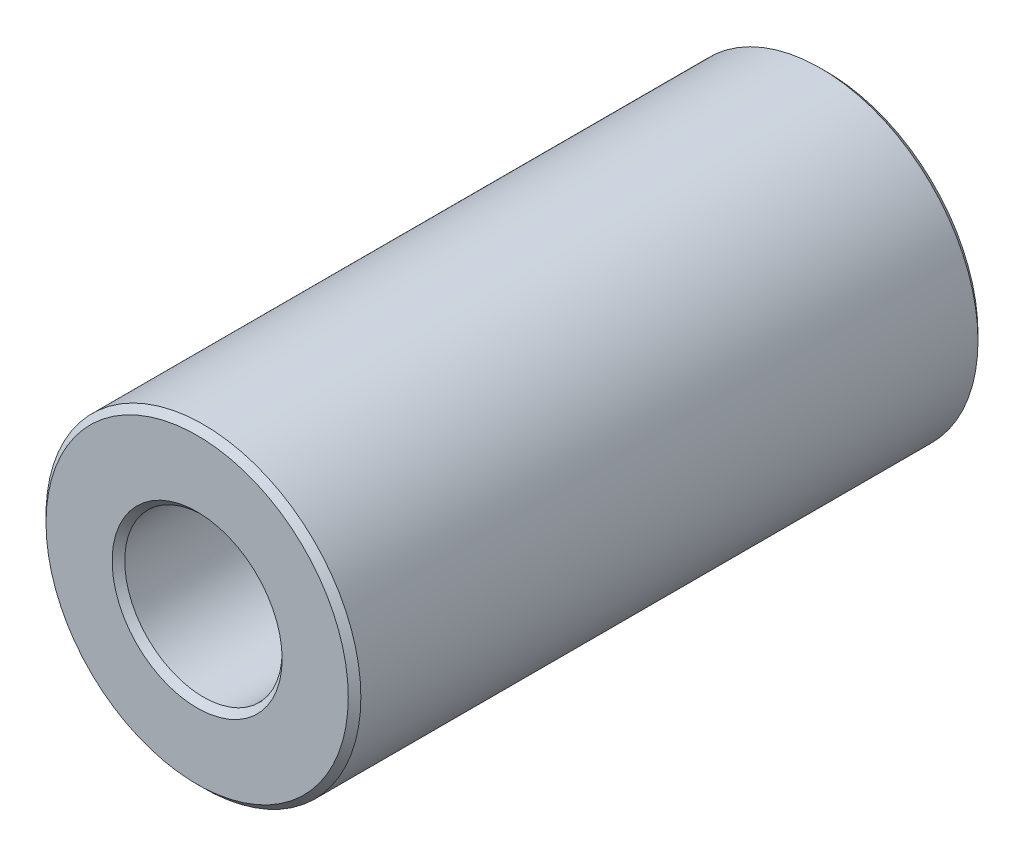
ISO-10303-21;
HEADER;
FILE_DESCRIPTION(('STEP AP214'),'2;1');
FILE_NAME('part.step','',(''),(''),'','','');
FILE_SCHEMA(('AUTOMOTIVE_DESIGN { 1 0 10303 214 1 1 1 1 }'));
ENDSEC;
DATA;
#1=APPLICATION_CONTEXT('core data for automotive mechanical design processes');
#2=APPLICATION_PROTOCOL_DEFINITION('international standard','automotive_design',2000,#1);
#3=PRODUCT_CONTEXT('',#1,'mechanical');
#4=PRODUCT('Part','Part','',(#3));
#5=PRODUCT_RELATED_PRODUCT_CATEGORY('part','',(#4));
#6=PRODUCT_DEFINITION_FORMATION('','',#4);
#7=PRODUCT_DEFINITION_CONTEXT('part definition',#1,'design');
#8=PRODUCT_DEFINITION('design','',#6,#7);
#9=PRODUCT_DEFINITION_SHAPE('','',#8);
#10=(LENGTH_UNIT() NAMED_UNIT(*) SI_UNIT(.MILLI.,.METRE.));
#11=(NAMED_UNIT(*) PLANE_ANGLE_UNIT() SI_UNIT($,.RADIAN.));
#12=(NAMED_UNIT(*) SI_UNIT($,.STERADIAN.) SOLID_ANGLE_UNIT());
#13=UNCERTAINTY_MEASURE_WITH_UNIT(LENGTH_MEASURE(1.E-05),#10,'distance_accuracy_value','');
#14=(GEOMETRIC_REPRESENTATION_CONTEXT(3) GLOBAL_UNCERTAINTY_ASSIGNED_CONTEXT((#13)) GLOBAL_UNIT_ASSIGNED_CONTEXT((#10,
#11,#12)) REPRESENTATION_CONTEXT('',''));
#15=CARTESIAN_POINT('',(0.,0.,0.));
#16=DIRECTION('',(0.,0.,1.));
#17=DIRECTION('',(1.,0.,0.));
#18=AXIS2_PLACEMENT_3D('',#15,#16,#17);
#19=CARTESIAN_POINT('',(0.,0.,5.));
#20=DIRECTION('',(0.,0.,1.));
#21=DIRECTION('',(1.,0.,0.));
#22=AXIS2_PLACEMENT_3D('',#19,#20,#21);
#23=PLANE('',#22);
#24=CARTESIAN_POINT('',(0.,0.,5.));
#25=DIRECTION('',(0.,0.,1.));
#26=DIRECTION('',(1.,0.,0.));
#27=AXIS2_PLACEMENT_3D('',#24,#25,#26);
#28=CIRCLE('',#27,1.35000000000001);
#29=CARTESIAN_POINT('',(1.35000000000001,0.,5.));
#30=VERTEX_POINT('',#29);
#31=EDGE_CURVE('E10',#30,#30,#28,.F.);
#32=ORIENTED_EDGE('',*,*,#31,.T.);
#33=EDGE_LOOP('',(#32));
#34=FACE_BOUND('',#33,.T.);
#35=CARTESIAN_POINT('',(0.,0.,5.));
#36=DIRECTION('',(0.,0.,1.));
#37=DIRECTION('',(1.,0.,0.));
#38=AXIS2_PLACEMENT_3D('',#35,#36,#37);
#39=CIRCLE('',#38,2.4);
#40=CARTESIAN_POINT('',(2.4,0.,5.));
#41=VERTEX_POINT('',#40);
#42=EDGE_CURVE('E45',#41,#41,#39,.T.);
#43=ORIENTED_EDGE('',*,*,#42,.T.);
#44=EDGE_LOOP('',(#43));
#45=FACE_BOUND('',#44,.T.);
#46=ADVANCED_FACE('F37',(#34,#45),#23,.T.);
#47=CARTESIAN_POINT('',(0.,0.,-5.));
#48=DIRECTION('',(0.,0.,1.));
#49=DIRECTION('',(1.,0.,0.));
#50=AXIS2_PLACEMENT_3D('',#47,#48,#49);
#51=PLANE('',#50);
#52=CARTESIAN_POINT('',(0.,0.,-5.));
#53=DIRECTION('',(0.,0.,1.));
#54=DIRECTION('',(1.,0.,0.));
#55=AXIS2_PLACEMENT_3D('',#52,#53,#54);
#56=CIRCLE('',#55,2.4);
#57=CARTESIAN_POINT('',(2.4,0.,-5.));
#58=VERTEX_POINT('',#57);
#59=EDGE_CURVE('E64',#58,#58,#56,.F.);
#60=ORIENTED_EDGE('',*,*,#59,.T.);
#61=EDGE_LOOP('',(#60));
#62=FACE_BOUND('',#61,.T.);
#63=CARTESIAN_POINT('',(0.,0.,-5.));
#64=DIRECTION('',(0.,0.,1.));
#65=DIRECTION('',(1.,0.,0.));
#66=AXIS2_PLACEMENT_3D('',#63,#64,#65);
#67=CIRCLE('',#66,1.35);
#68=CARTESIAN_POINT('',(1.35,0.,-5.));
#69=VERTEX_POINT('',#68);
#70=EDGE_CURVE('E67',#69,#69,#67,.T.);
#71=ORIENTED_EDGE('',*,*,#70,.T.);
#72=EDGE_LOOP('',(#71));
#73=FACE_BOUND('',#72,.T.);
#74=ADVANCED_FACE('F89',(#62,#73),#51,.F.);
#75=CARTESIAN_POINT('',(0.,0.,5.));
#76=DIRECTION('',(0.,0.,-1.));
#77=DIRECTION('',(-1.,0.,0.));
#78=AXIS2_PLACEMENT_3D('',#75,#76,#77);
#79=CYLINDRICAL_SURFACE('',#78,2.5);
#80=CARTESIAN_POINT('',(0.,0.,-4.9));
#81=DIRECTION('',(0.,0.,1.));
#82=DIRECTION('',(1.,0.,0.));
#83=AXIS2_PLACEMENT_3D('',#80,#81,#82);
#84=CIRCLE('',#83,2.5);
#85=CARTESIAN_POINT('',(2.5,0.,-4.9));
#86=VERTEX_POINT('',#85);
#87=EDGE_CURVE('E71',#86,#86,#84,.T.);
#88=ORIENTED_EDGE('',*,*,#87,.T.);
#89=EDGE_LOOP('',(#88));
#90=FACE_BOUND('',#89,.T.);
#91=CARTESIAN_POINT('',(0.,0.,4.9));
#92=DIRECTION('',(0.,0.,1.));
#93=DIRECTION('',(1.,0.,0.));
#94=AXIS2_PLACEMENT_3D('',#91,#92,#93);
#95=CIRCLE('',#94,2.5);
#96=CARTESIAN_POINT('',(2.5,0.,4.9));
#97=VERTEX_POINT('',#96);
#98=EDGE_CURVE('E74',#97,#97,#95,.F.);
#99=ORIENTED_EDGE('',*,*,#98,.T.);
#100=EDGE_LOOP('',(#99));
#101=FACE_BOUND('',#100,.T.);
#102=ADVANCED_FACE('F78',(#90,#101),#79,.T.);
#103=CARTESIAN_POINT('',(0.,0.,5.));
#104=DIRECTION('',(0.,0.,-1.));
#105=DIRECTION('',(-1.,0.,0.));
#106=AXIS2_PLACEMENT_3D('',#103,#104,#105);
#107=CYLINDRICAL_SURFACE('',#106,1.25);
#108=CARTESIAN_POINT('',(0.,0.,-4.9));
#109=DIRECTION('',(0.,0.,1.));
#110=DIRECTION('',(1.,0.,0.));
#111=AXIS2_PLACEMENT_3D('',#108,#109,#110);
#112=CIRCLE('',#111,1.25);
#113=CARTESIAN_POINT('',(1.25,0.,-4.9));
#114=VERTEX_POINT('',#113);
#115=EDGE_CURVE('E52',#114,#114,#112,.F.);
#116=ORIENTED_EDGE('',*,*,#115,.T.);
#117=EDGE_LOOP('',(#116));
#118=FACE_BOUND('',#117,.T.);
#119=CARTESIAN_POINT('',(0.,0.,4.9));
#120=DIRECTION('',(0.,0.,1.));
#121=DIRECTION('',(1.,0.,0.));
#122=AXIS2_PLACEMENT_3D('',#119,#120,#121);
#123=CIRCLE('',#122,1.25);
#124=CARTESIAN_POINT('',(1.25,0.,4.9));
#125=VERTEX_POINT('',#124);
#126=EDGE_CURVE('E59',#125,#125,#123,.T.);
#127=ORIENTED_EDGE('',*,*,#126,.T.);
#128=EDGE_LOOP('',(#127));
#129=FACE_BOUND('',#128,.T.);
#130=ADVANCED_FACE('F97',(#118,#129),#107,.F.);
#131=CARTESIAN_POINT('',(0.,0.,-4.9));
#132=DIRECTION('',(0.,0.,1.));
#133=DIRECTION('',(1.,0.,0.));
#134=AXIS2_PLACEMENT_3D('',#131,#132,#133);
#135=CONICAL_SURFACE('',#134,2.5,0.78539816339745);
#136=ORIENTED_EDGE('',*,*,#59,.F.);
#137=EDGE_LOOP('',(#136));
#138=FACE_BOUND('',#137,.T.);
#139=ORIENTED_EDGE('',*,*,#87,.F.);
#140=EDGE_LOOP('',(#139));
#141=FACE_BOUND('',#140,.T.);
#142=ADVANCED_FACE('F102',(#138,#141),#135,.T.);
#143=CARTESIAN_POINT('',(0.,0.,-5.));
#144=DIRECTION('',(0.,0.,-1.));
#145=DIRECTION('',(-1.,0.,0.));
#146=AXIS2_PLACEMENT_3D('',#143,#144,#145);
#147=CONICAL_SURFACE('',#146,1.35,0.785398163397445);
#148=ORIENTED_EDGE('',*,*,#115,.F.);
#149=EDGE_LOOP('',(#148));
#150=FACE_BOUND('',#149,.T.);
#151=ORIENTED_EDGE('',*,*,#70,.F.);
#152=EDGE_LOOP('',(#151));
#153=FACE_BOUND('',#152,.T.);
#154=ADVANCED_FACE('F86',(#150,#153),#147,.F.);
#155=CARTESIAN_POINT('',(0.,0.,4.9));
#156=DIRECTION('',(0.,0.,1.));
#157=DIRECTION('',(1.,0.,0.));
#158=AXIS2_PLACEMENT_3D('',#155,#156,#157);
#159=CONICAL_SURFACE('',#158,1.25,0.785398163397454);
#160=ORIENTED_EDGE('',*,*,#31,.F.);
#161=EDGE_LOOP('',(#160));
#162=FACE_BOUND('',#161,.T.);
#163=ORIENTED_EDGE('',*,*,#126,.F.);
#164=EDGE_LOOP('',(#163));
#165=FACE_BOUND('',#164,.T.);
#166=ADVANCED_FACE('F82',(#162,#165),#159,.F.);
#167=CARTESIAN_POINT('',(0.,0.,5.));
#168=DIRECTION('',(0.,0.,-1.));
#169=DIRECTION('',(-1.,0.,0.));
#170=AXIS2_PLACEMENT_3D('',#167,#168,#169);
#171=CONICAL_SURFACE('',#170,2.4,0.78539816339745);
#172=ORIENTED_EDGE('',*,*,#98,.F.);
#173=EDGE_LOOP('',(#172));
#174=FACE_BOUND('',#173,.T.);
#175=ORIENTED_EDGE('',*,*,#42,.F.);
#176=EDGE_LOOP('',(#175));
#177=FACE_BOUND('',#176,.T.);
#178=ADVANCED_FACE('F39',(#174,#177),#171,.T.);
#179=CLOSED_SHELL('',(#46,#74,#102,#130,#142,#154,#166,#178));
#180=MANIFOLD_SOLID_BREP('B2',#179);
#181=ADVANCED_BREP_SHAPE_REPRESENTATION('',(#18,#180),#14);
#182=SHAPE_DEFINITION_REPRESENTATION(#9,#181);
ENDSEC;
END-ISO-10303-21;
